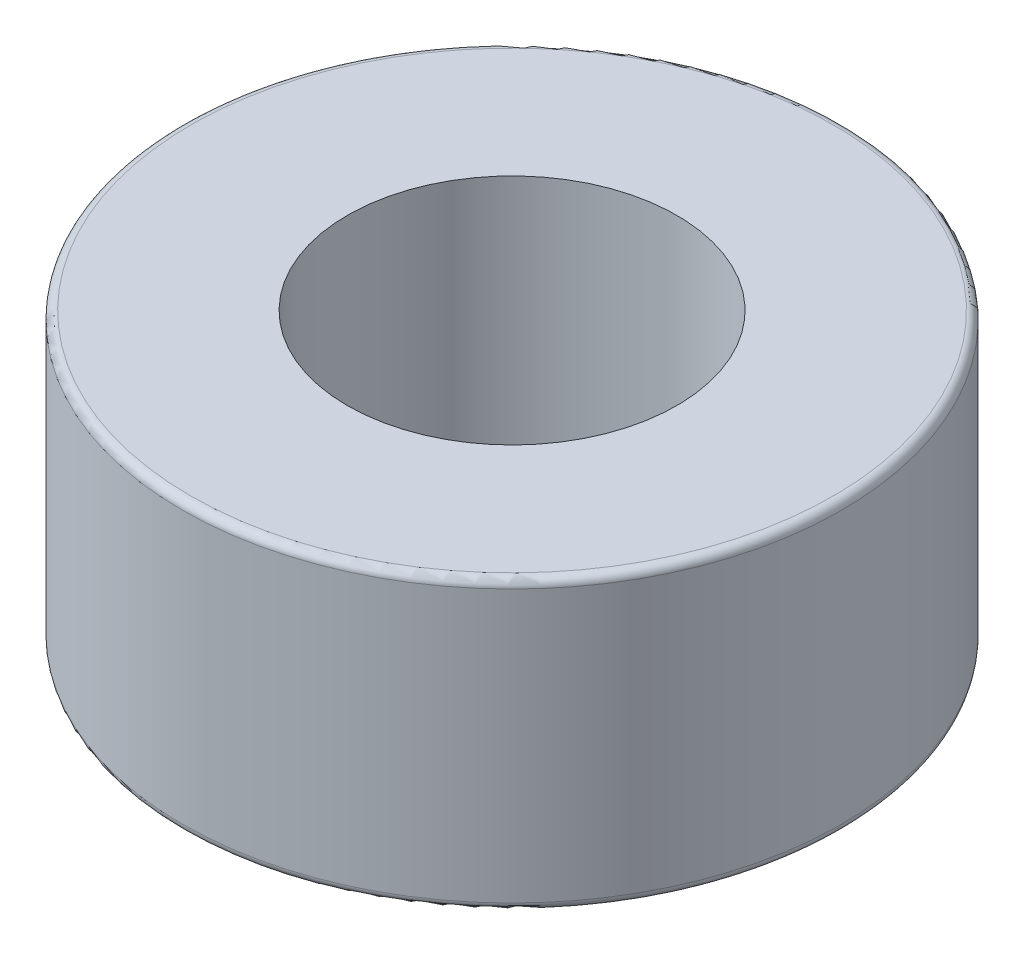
ISO-10303-21;
HEADER;
FILE_DESCRIPTION(('STEP AP214'),'2;1');
FILE_NAME('part.step','',(''),(''),'','','');
FILE_SCHEMA(('AUTOMOTIVE_DESIGN { 1 0 10303 214 1 1 1 1 }'));
ENDSEC;
DATA;
#1=APPLICATION_CONTEXT('core data for automotive mechanical design processes');
#2=APPLICATION_PROTOCOL_DEFINITION('international standard','automotive_design',2000,#1);
#3=PRODUCT_CONTEXT('',#1,'mechanical');
#4=PRODUCT('Part','Part','',(#3));
#5=PRODUCT_RELATED_PRODUCT_CATEGORY('part','',(#4));
#6=PRODUCT_DEFINITION_FORMATION('','',#4);
#7=PRODUCT_DEFINITION_CONTEXT('part definition',#1,'design');
#8=PRODUCT_DEFINITION('design','',#6,#7);
#9=PRODUCT_DEFINITION_SHAPE('','',#8);
#10=(LENGTH_UNIT() NAMED_UNIT(*) SI_UNIT(.MILLI.,.METRE.));
#11=(NAMED_UNIT(*) PLANE_ANGLE_UNIT() SI_UNIT($,.RADIAN.));
#12=(NAMED_UNIT(*) SI_UNIT($,.STERADIAN.) SOLID_ANGLE_UNIT());
#13=UNCERTAINTY_MEASURE_WITH_UNIT(LENGTH_MEASURE(1.E-05),#10,'distance_accuracy_value','');
#14=(GEOMETRIC_REPRESENTATION_CONTEXT(3) GLOBAL_UNCERTAINTY_ASSIGNED_CONTEXT((#13)) GLOBAL_UNIT_ASSIGNED_CONTEXT((#10,
#11,#12)) REPRESENTATION_CONTEXT('',''));
#15=CARTESIAN_POINT('',(0.,0.,0.));
#16=DIRECTION('',(0.,0.,1.));
#17=DIRECTION('',(1.,0.,0.));
#18=AXIS2_PLACEMENT_3D('',#15,#16,#17);
#19=CARTESIAN_POINT('',(0.,7.,0.));
#20=DIRECTION('',(0.,1.,0.));
#21=DIRECTION('',(0.,0.,1.));
#22=AXIS2_PLACEMENT_3D('',#19,#20,#21);
#23=PLANE('',#22);
#24=CARTESIAN_POINT('',(0.,7.,0.));
#25=DIRECTION('',(0.,1.,0.));
#26=DIRECTION('',(0.,0.,1.));
#27=AXIS2_PLACEMENT_3D('',#24,#25,#26);
#28=CIRCLE('',#27,7.8);
#29=CARTESIAN_POINT('',(0.,7.,7.8));
#30=VERTEX_POINT('',#29);
#31=EDGE_CURVE('E10',#30,#30,#28,.T.);
#32=ORIENTED_EDGE('',*,*,#31,.T.);
#33=EDGE_LOOP('',(#32));
#34=FACE_BOUND('',#33,.T.);
#35=CARTESIAN_POINT('',(0.,7.,0.));
#36=DIRECTION('',(0.,1.,0.));
#37=DIRECTION('',(0.,0.,1.));
#38=AXIS2_PLACEMENT_3D('',#35,#36,#37);
#39=CIRCLE('',#38,4.);
#40=CARTESIAN_POINT('',(0.,7.,4.));
#41=VERTEX_POINT('',#40);
#42=EDGE_CURVE('E51',#41,#41,#39,.T.);
#43=ORIENTED_EDGE('',*,*,#42,.F.);
#44=EDGE_LOOP('',(#43));
#45=FACE_BOUND('',#44,.T.);
#46=ADVANCED_FACE('F31',(#34,#45),#23,.T.);
#47=CARTESIAN_POINT('',(0.,0.,0.));
#48=DIRECTION('',(0.,1.,0.));
#49=DIRECTION('',(0.,0.,1.));
#50=AXIS2_PLACEMENT_3D('',#47,#48,#49);
#51=PLANE('',#50);
#52=CARTESIAN_POINT('',(0.,0.,0.));
#53=DIRECTION('',(0.,1.,0.));
#54=DIRECTION('',(0.,0.,1.));
#55=AXIS2_PLACEMENT_3D('',#52,#53,#54);
#56=CIRCLE('',#55,7.8);
#57=CARTESIAN_POINT('',(0.,0.,7.8));
#58=VERTEX_POINT('',#57);
#59=EDGE_CURVE('E38',#58,#58,#56,.F.);
#60=ORIENTED_EDGE('',*,*,#59,.T.);
#61=EDGE_LOOP('',(#60));
#62=FACE_BOUND('',#61,.T.);
#63=CARTESIAN_POINT('',(0.,0.,0.));
#64=DIRECTION('',(0.,1.,0.));
#65=DIRECTION('',(0.,0.,1.));
#66=AXIS2_PLACEMENT_3D('',#63,#64,#65);
#67=CIRCLE('',#66,4.);
#68=CARTESIAN_POINT('',(0.,0.,4.));
#69=VERTEX_POINT('',#68);
#70=EDGE_CURVE('E52',#69,#69,#67,.T.);
#71=ORIENTED_EDGE('',*,*,#70,.T.);
#72=EDGE_LOOP('',(#71));
#73=FACE_BOUND('',#72,.T.);
#74=ADVANCED_FACE('F62',(#62,#73),#51,.F.);
#75=CARTESIAN_POINT('',(0.,7.,0.));
#76=DIRECTION('',(0.,-1.,0.));
#77=DIRECTION('',(0.,0.,-1.));
#78=AXIS2_PLACEMENT_3D('',#75,#76,#77);
#79=CYLINDRICAL_SURFACE('',#78,8.);
#80=CARTESIAN_POINT('',(0.,0.2,0.));
#81=DIRECTION('',(0.,1.,0.));
#82=DIRECTION('',(0.,0.,1.));
#83=AXIS2_PLACEMENT_3D('',#80,#81,#82);
#84=CIRCLE('',#83,8.);
#85=CARTESIAN_POINT('',(0.,0.2,8.));
#86=VERTEX_POINT('',#85);
#87=EDGE_CURVE('E42',#86,#86,#84,.T.);
#88=ORIENTED_EDGE('',*,*,#87,.T.);
#89=EDGE_LOOP('',(#88));
#90=FACE_BOUND('',#89,.T.);
#91=CARTESIAN_POINT('',(0.,6.8,0.));
#92=DIRECTION('',(0.,1.,0.));
#93=DIRECTION('',(0.,0.,1.));
#94=AXIS2_PLACEMENT_3D('',#91,#92,#93);
#95=CIRCLE('',#94,8.);
#96=CARTESIAN_POINT('',(0.,6.8,8.));
#97=VERTEX_POINT('',#96);
#98=EDGE_CURVE('E46',#97,#97,#95,.F.);
#99=ORIENTED_EDGE('',*,*,#98,.T.);
#100=EDGE_LOOP('',(#99));
#101=FACE_BOUND('',#100,.T.);
#102=ADVANCED_FACE('F67',(#90,#101),#79,.T.);
#103=CARTESIAN_POINT('',(0.,7.,0.));
#104=DIRECTION('',(0.,-1.,0.));
#105=DIRECTION('',(0.,0.,-1.));
#106=AXIS2_PLACEMENT_3D('',#103,#104,#105);
#107=CYLINDRICAL_SURFACE('',#106,4.);
#108=ORIENTED_EDGE('',*,*,#42,.T.);
#109=EDGE_LOOP('',(#108));
#110=FACE_BOUND('',#109,.T.);
#111=ORIENTED_EDGE('',*,*,#70,.F.);
#112=EDGE_LOOP('',(#111));
#113=FACE_BOUND('',#112,.T.);
#114=ADVANCED_FACE('F58',(#110,#113),#107,.F.);
#115=CARTESIAN_POINT('',(0.,0.2,0.));
#116=DIRECTION('',(0.,1.,0.));
#117=DIRECTION('',(0.,0.,1.));
#118=AXIS2_PLACEMENT_3D('',#115,#116,#117);
#119=TOROIDAL_SURFACE('',#118,7.8,0.2);
#120=ORIENTED_EDGE('',*,*,#59,.F.);
#121=EDGE_LOOP('',(#120));
#122=FACE_BOUND('',#121,.T.);
#123=ORIENTED_EDGE('',*,*,#87,.F.);
#124=EDGE_LOOP('',(#123));
#125=FACE_BOUND('',#124,.T.);
#126=ADVANCED_FACE('F73',(#122,#125),#119,.T.);
#127=CARTESIAN_POINT('',(0.,6.8,0.));
#128=DIRECTION('',(0.,1.,0.));
#129=DIRECTION('',(0.,0.,1.));
#130=AXIS2_PLACEMENT_3D('',#127,#128,#129);
#131=TOROIDAL_SURFACE('',#130,7.8,0.2);
#132=ORIENTED_EDGE('',*,*,#98,.F.);
#133=EDGE_LOOP('',(#132));
#134=FACE_BOUND('',#133,.T.);
#135=ORIENTED_EDGE('',*,*,#31,.F.);
#136=EDGE_LOOP('',(#135));
#137=FACE_BOUND('',#136,.T.);
#138=ADVANCED_FACE('F33',(#134,#137),#131,.T.);
#139=CLOSED_SHELL('',(#46,#74,#102,#114,#126,#138));
#140=MANIFOLD_SOLID_BREP('B2',#139);
#141=ADVANCED_BREP_SHAPE_REPRESENTATION('',(#18,#140),#14);
#142=SHAPE_DEFINITION_REPRESENTATION(#9,#141);
ENDSEC;
END-ISO-10303-21;
